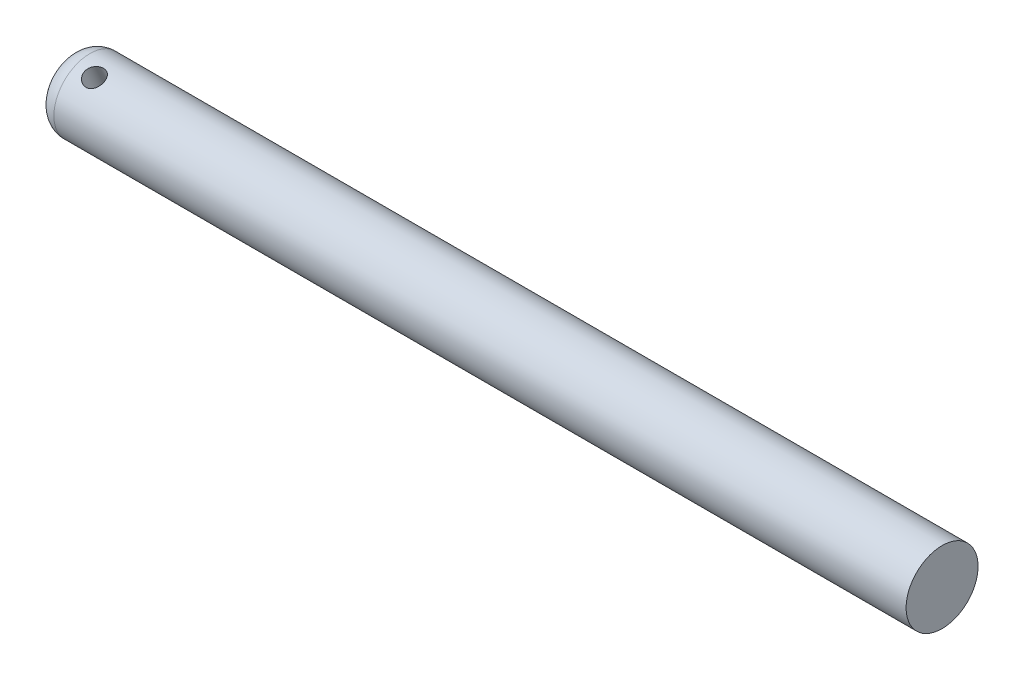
ISO-10303-21;
HEADER;
FILE_DESCRIPTION(('STEP AP214'),'2;1');
FILE_NAME('part.step','',(''),(''),'','','');
FILE_SCHEMA(('AUTOMOTIVE_DESIGN { 1 0 10303 214 1 1 1 1 }'));
ENDSEC;
DATA;
#1=APPLICATION_CONTEXT('core data for automotive mechanical design processes');
#2=APPLICATION_PROTOCOL_DEFINITION('international standard','automotive_design',2000,#1);
#3=PRODUCT_CONTEXT('',#1,'mechanical');
#4=PRODUCT('Part','Part','',(#3));
#5=PRODUCT_RELATED_PRODUCT_CATEGORY('part','',(#4));
#6=PRODUCT_DEFINITION_FORMATION('','',#4);
#7=PRODUCT_DEFINITION_CONTEXT('part definition',#1,'design');
#8=PRODUCT_DEFINITION('design','',#6,#7);
#9=PRODUCT_DEFINITION_SHAPE('','',#8);
#10=(LENGTH_UNIT() NAMED_UNIT(*) SI_UNIT(.MILLI.,.METRE.));
#11=(NAMED_UNIT(*) PLANE_ANGLE_UNIT() SI_UNIT($,.RADIAN.));
#12=(NAMED_UNIT(*) SI_UNIT($,.STERADIAN.) SOLID_ANGLE_UNIT());
#13=UNCERTAINTY_MEASURE_WITH_UNIT(LENGTH_MEASURE(1.E-05),#10,'distance_accuracy_value','');
#14=(GEOMETRIC_REPRESENTATION_CONTEXT(3) GLOBAL_UNCERTAINTY_ASSIGNED_CONTEXT((#13)) GLOBAL_UNIT_ASSIGNED_CONTEXT((#10,
#11,#12)) REPRESENTATION_CONTEXT('',''));
#15=CARTESIAN_POINT('',(0.,0.,0.));
#16=DIRECTION('',(0.,0.,1.));
#17=DIRECTION('',(1.,0.,0.));
#18=AXIS2_PLACEMENT_3D('',#15,#16,#17);
#19=CARTESIAN_POINT('',(-52.7444416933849,153.686378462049,0.));
#20=DIRECTION('',(-1.,0.,0.));
#21=DIRECTION('',(0.,0.,1.));
#22=AXIS2_PLACEMENT_3D('',#19,#20,#21);
#23=PLANE('',#22);
#24=CARTESIAN_POINT('',(-52.7444416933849,151.804700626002,0.));
#25=DIRECTION('',(-1.,0.,0.));
#26=DIRECTION('',(0.,0.,1.));
#27=AXIS2_PLACEMENT_3D('',#24,#25,#26);
#28=CIRCLE('',#27,1.88167783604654);
#29=CARTESIAN_POINT('',(-52.7444416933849,151.804700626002,1.88167783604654));
#30=VERTEX_POINT('',#29);
#31=EDGE_CURVE('E40',#30,#30,#28,.T.);
#32=ORIENTED_EDGE('',*,*,#31,.F.);
#33=EDGE_LOOP('',(#32));
#34=FACE_BOUND('',#33,.T.);
#35=ADVANCED_FACE('F30',(#34),#23,.F.);
#36=CARTESIAN_POINT('',(-98.293848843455,151.804700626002,0.));
#37=DIRECTION('',(-1.,0.,0.));
#38=DIRECTION('',(0.,0.,1.));
#39=AXIS2_PLACEMENT_3D('',#36,#37,#38);
#40=CYLINDRICAL_SURFACE('',#39,1.88167783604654);
#41=CARTESIAN_POINT('',(-97.293848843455,151.804700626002,0.));
#42=DIRECTION('',(1.,0.,0.));
#43=DIRECTION('',(0.,0.,-1.));
#44=AXIS2_PLACEMENT_3D('',#41,#42,#43);
#45=CIRCLE('',#44,1.88167783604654);
#46=CARTESIAN_POINT('',(-97.293848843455,151.804700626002,-1.88167783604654));
#47=VERTEX_POINT('',#46);
#48=EDGE_CURVE('E10',#47,#47,#45,.T.);
#49=ORIENTED_EDGE('',*,*,#48,.T.);
#50=EDGE_LOOP('',(#49));
#51=FACE_BOUND('',#50,.T.);
#52=CARTESIAN_POINT('',(-96.293848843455,149.945334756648,-0.288911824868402));
#53=CARTESIAN_POINT('',(-96.2663009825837,149.945334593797,-0.288912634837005));
#54=CARTESIAN_POINT('',(-96.2387459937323,149.945694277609,-0.2912552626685));
#55=CARTESIAN_POINT('',(-96.1844315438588,149.947170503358,-0.300523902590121));
#56=CARTESIAN_POINT('',(-96.1576724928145,149.948287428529,-0.307452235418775));
#57=CARTESIAN_POINT('',(-96.1057434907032,149.951381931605,-0.325584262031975));
#58=CARTESIAN_POINT('',(-96.0805713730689,149.953358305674,-0.336781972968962));
#59=CARTESIAN_POINT('',(-96.0324296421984,149.958324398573,-0.363020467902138));
#60=CARTESIAN_POINT('',(-96.0094601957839,149.961314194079,-0.378061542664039));
#61=CARTESIAN_POINT('',(-95.9658053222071,149.968562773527,-0.411841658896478));
#62=CARTESIAN_POINT('',(-95.9451827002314,149.972848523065,-0.430656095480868));
#63=CARTESIAN_POINT('',(-95.9073619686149,149.982840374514,-0.471137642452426));
#64=CARTESIAN_POINT('',(-95.8901642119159,149.988546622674,-0.492805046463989));
#65=CARTESIAN_POINT('',(-95.8594197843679,150.001615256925,-0.538675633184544));
#66=CARTESIAN_POINT('',(-95.8459355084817,150.009002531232,-0.562913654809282));
#67=CARTESIAN_POINT('',(-95.8234076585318,150.025426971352,-0.612851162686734));
#68=CARTESIAN_POINT('',(-95.8143633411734,150.034463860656,-0.638550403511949));
#69=CARTESIAN_POINT('',(-95.8011752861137,150.053880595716,-0.689984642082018));
#70=CARTESIAN_POINT('',(-95.7969247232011,150.064225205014,-0.715705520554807));
#71=CARTESIAN_POINT('',(-95.7931087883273,150.086189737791,-0.766947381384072));
#72=CARTESIAN_POINT('',(-95.7935426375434,150.097809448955,-0.792468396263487));
#73=CARTESIAN_POINT('',(-95.7990078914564,150.121662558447,-0.841920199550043));
#74=CARTESIAN_POINT('',(-95.80392388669,150.133873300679,-0.865874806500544));
#75=CARTESIAN_POINT('',(-95.8180274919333,150.158733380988,-0.912247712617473));
#76=CARTESIAN_POINT('',(-95.8272153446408,150.171382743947,-0.934665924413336));
#77=CARTESIAN_POINT('',(-95.8496905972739,150.196745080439,-0.977660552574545));
#78=CARTESIAN_POINT('',(-95.8630176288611,150.209457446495,-0.998216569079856));
#79=CARTESIAN_POINT('',(-95.8933625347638,150.234273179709,-1.03682038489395));
#80=CARTESIAN_POINT('',(-95.9103811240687,150.246376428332,-1.05486769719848));
#81=CARTESIAN_POINT('',(-95.948239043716,150.269767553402,-1.08863546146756));
#82=CARTESIAN_POINT('',(-95.9691790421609,150.281019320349,-1.10426819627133));
#83=CARTESIAN_POINT('',(-96.0139667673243,150.301687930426,-1.1322400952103));
#84=CARTESIAN_POINT('',(-96.0378146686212,150.3111046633,-1.14457906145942));
#85=CARTESIAN_POINT('',(-96.0879456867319,150.327604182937,-1.1657959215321));
#86=CARTESIAN_POINT('',(-96.1142427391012,150.334672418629,-1.17465229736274));
#87=CARTESIAN_POINT('',(-96.1684023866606,150.345931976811,-1.18860708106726));
#88=CARTESIAN_POINT('',(-96.1962645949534,150.350124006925,-1.19370641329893));
#89=CARTESIAN_POINT('',(-96.2518774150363,150.35525990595,-1.19993708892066));
#90=CARTESIAN_POINT('',(-96.2796067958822,150.356296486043,-1.20118170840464));
#91=CARTESIAN_POINT('',(-96.3349302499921,150.355313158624,-1.19999502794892));
#92=CARTESIAN_POINT('',(-96.3625243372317,150.353293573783,-1.19756411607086));
#93=CARTESIAN_POINT('',(-96.416250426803,150.34640468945,-1.18916470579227));
#94=CARTESIAN_POINT('',(-96.4424002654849,150.341590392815,-1.18326445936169));
#95=CARTESIAN_POINT('',(-96.4930949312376,150.329458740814,-1.1681038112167));
#96=CARTESIAN_POINT('',(-96.5176395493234,150.322141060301,-1.15884297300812));
#97=CARTESIAN_POINT('',(-96.565018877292,150.305241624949,-1.13689465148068));
#98=CARTESIAN_POINT('',(-96.5878045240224,150.295613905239,-1.12413673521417));
#99=CARTESIAN_POINT('',(-96.6304888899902,150.274710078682,-1.0955153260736));
#100=CARTESIAN_POINT('',(-96.650387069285,150.263433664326,-1.07965125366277));
#101=CARTESIAN_POINT('',(-96.687317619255,150.239454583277,-1.04459524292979));
#102=CARTESIAN_POINT('',(-96.7042514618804,150.226720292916,-1.02532092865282));
#103=CARTESIAN_POINT('',(-96.7340508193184,150.20072487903,-0.984156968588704));
#104=CARTESIAN_POINT('',(-96.7469165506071,150.18746378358,-0.96226746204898));
#105=CARTESIAN_POINT('',(-96.7680966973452,150.161121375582,-0.916541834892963));
#106=CARTESIAN_POINT('',(-96.7764450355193,150.148039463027,-0.892721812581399));
#107=CARTESIAN_POINT('',(-96.7884520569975,150.122500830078,-0.843611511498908));
#108=CARTESIAN_POINT('',(-96.7921117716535,150.110043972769,-0.81832155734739));
#109=CARTESIAN_POINT('',(-96.7945734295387,150.086573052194,-0.767790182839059));
#110=CARTESIAN_POINT('',(-96.793519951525,150.075526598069,-0.742570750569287));
#111=CARTESIAN_POINT('',(-96.7869205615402,150.054746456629,-0.692181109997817));
#112=CARTESIAN_POINT('',(-96.7813748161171,150.045012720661,-0.667010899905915));
#113=CARTESIAN_POINT('',(-96.7660298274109,150.027086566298,-0.617644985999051));
#114=CARTESIAN_POINT('',(-96.7562597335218,150.018884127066,-0.593443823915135));
#115=CARTESIAN_POINT('',(-96.7327694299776,150.00397680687,-0.546544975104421));
#116=CARTESIAN_POINT('',(-96.719048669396,149.997272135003,-0.523847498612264));
#117=CARTESIAN_POINT('',(-96.6876223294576,149.985140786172,-0.480045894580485));
#118=CARTESIAN_POINT('',(-96.6698207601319,149.979752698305,-0.458999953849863));
#119=CARTESIAN_POINT('',(-96.6309204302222,149.970348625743,-0.419845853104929));
#120=CARTESIAN_POINT('',(-96.6098208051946,149.966333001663,-0.401738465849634));
#121=CARTESIAN_POINT('',(-96.5643700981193,149.959421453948,-0.368710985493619));
#122=CARTESIAN_POINT('',(-96.539958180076,149.956551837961,-0.353868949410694));
#123=CARTESIAN_POINT('',(-96.4889180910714,149.951867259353,-0.328463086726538));
#124=CARTESIAN_POINT('',(-96.4622913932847,149.950051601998,-0.3178964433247));
#125=CARTESIAN_POINT('',(-96.4121079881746,149.947539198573,-0.302837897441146));
#126=CARTESIAN_POINT('',(-96.3887701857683,149.94670721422,-0.29763109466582));
#127=CARTESIAN_POINT('',(-96.341572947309,149.945605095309,-0.290667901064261));
#128=CARTESIAN_POINT('',(-96.3177135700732,149.945334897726,-0.288911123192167));
#129=CARTESIAN_POINT('',(-96.293848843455,149.945334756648,-0.288911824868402));
#130=B_SPLINE_CURVE_WITH_KNOTS('',3,(#52,#53,#54,#55,#56,#57,#58,#59,#60,#61,#62,#63,#64,#65,
#66,#67,#68,#69,#70,#71,#72,#73,#74,#75,#76,#77,#78,#79,#80,#81,#82,#83,#84,#85,#86,#87,#88,#89,
#90,#91,#92,#93,#94,#95,#96,#97,#98,#99,#100,#101,#102,#103,#104,#105,#106,#107,#108,#109,#110,
#111,#112,#113,#114,#115,#116,#117,#118,#119,#120,#121,#122,#123,#124,#125,#126,#127,#128,#129),
.UNSPECIFIED.,.T.,.F.,(4,2,2,2,2,2,2,2,2,2,2,2,2,2,2,2,2,2,2,2,2,2,2,2,2,2,2,2,2,2,2,2,2,2,2,2,
2,2,4),(0.,0.0825558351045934,0.165153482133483,0.247635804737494,0.330124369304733,
0.4144636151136,0.498811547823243,0.58450051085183,0.670175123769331,0.753900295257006,
0.837611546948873,0.919226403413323,1.00084589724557,1.08327231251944,1.1657147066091,
1.25067061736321,1.33563163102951,1.4211096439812,1.50656661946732,1.58948727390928,
1.67239917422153,1.75373208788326,1.83507556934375,1.91819592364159,2.00133180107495,
2.08685138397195,2.17236641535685,2.25723004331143,2.34207500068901,2.42433546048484,
2.50659287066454,2.58829151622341,2.670001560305,2.75387761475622,2.83777569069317,
2.92350208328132,3.0091719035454,3.08069809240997,3.15221625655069),.UNSPECIFIED.);
#131=CARTESIAN_POINT('',(-96.293848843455,149.945334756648,-0.288911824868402));
#132=VERTEX_POINT('',#131);
#133=EDGE_CURVE('E44',#132,#132,#130,.T.);
#134=ORIENTED_EDGE('',*,*,#133,.T.);
#135=EDGE_LOOP('',(#134));
#136=FACE_BOUND('',#135,.T.);
#137=CARTESIAN_POINT('',(-96.293848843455,153.253477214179,1.20073222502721));
#138=CARTESIAN_POINT('',(-96.3213967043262,153.2534779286,1.20073181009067));
#139=CARTESIAN_POINT('',(-96.3489516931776,153.254993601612,1.19890971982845));
#140=CARTESIAN_POINT('',(-96.4032661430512,153.260955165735,1.19166081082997));
#141=CARTESIAN_POINT('',(-96.4300251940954,153.26540254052,1.18623216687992));
#142=CARTESIAN_POINT('',(-96.4819541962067,153.276928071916,1.17189660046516));
#143=CARTESIAN_POINT('',(-96.507126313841,153.284002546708,1.16299454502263));
#144=CARTESIAN_POINT('',(-96.5552680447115,153.30035738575,1.14188435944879));
#145=CARTESIAN_POINT('',(-96.578237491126,153.309637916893,1.12967597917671));
#146=CARTESIAN_POINT('',(-96.6218923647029,153.330126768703,1.1018579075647));
#147=CARTESIAN_POINT('',(-96.6425149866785,153.341373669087,1.08617805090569));
#148=CARTESIAN_POINT('',(-96.680335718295,153.365062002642,1.05186397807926));
#149=CARTESIAN_POINT('',(-96.697533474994,153.377503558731,1.03322945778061));
#150=CARTESIAN_POINT('',(-96.728277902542,153.403187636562,0.993039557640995));
#151=CARTESIAN_POINT('',(-96.7417621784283,153.416439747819,0.971442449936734));
#152=CARTESIAN_POINT('',(-96.7642900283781,153.442944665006,0.926044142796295));
#153=CARTESIAN_POINT('',(-96.7733343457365,153.456197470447,0.90224331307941));
#154=CARTESIAN_POINT('',(-96.7865224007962,153.481839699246,0.853612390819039));
#155=CARTESIAN_POINT('',(-96.7907729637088,153.494241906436,0.828818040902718));
#156=CARTESIAN_POINT('',(-96.7945888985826,153.518051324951,0.77840692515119));
#157=CARTESIAN_POINT('',(-96.7941550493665,153.529458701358,0.752790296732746));
#158=CARTESIAN_POINT('',(-96.7886897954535,153.550675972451,0.702151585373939));
#159=CARTESIAN_POINT('',(-96.7837738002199,153.560518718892,0.677130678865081));
#160=CARTESIAN_POINT('',(-96.7696701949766,153.578763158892,0.627778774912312));
#161=CARTESIAN_POINT('',(-96.7604823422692,153.58716477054,0.603447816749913));
#162=CARTESIAN_POINT('',(-96.738007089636,153.602546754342,0.555959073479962));
#163=CARTESIAN_POINT('',(-96.7246800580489,153.609512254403,0.532815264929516));
#164=CARTESIAN_POINT('',(-96.6943351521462,153.621968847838,0.488646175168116));
#165=CARTESIAN_POINT('',(-96.6773165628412,153.62745965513,0.467621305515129));
#166=CARTESIAN_POINT('',(-96.6394586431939,153.637239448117,0.427724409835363));
#167=CARTESIAN_POINT('',(-96.6185186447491,153.64148668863,0.408937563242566));
#168=CARTESIAN_POINT('',(-96.5737309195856,153.64873129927,0.374920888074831));
#169=CARTESIAN_POINT('',(-96.5498830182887,153.651728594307,0.359691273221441));
#170=CARTESIAN_POINT('',(-96.499752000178,153.656678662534,0.33327373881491));
#171=CARTESIAN_POINT('',(-96.4734549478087,153.65862496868,0.322110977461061));
#172=CARTESIAN_POINT('',(-96.4192953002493,153.661610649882,0.304430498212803));
#173=CARTESIAN_POINT('',(-96.3914330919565,153.66265024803,0.297911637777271));
#174=CARTESIAN_POINT('',(-96.3358202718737,153.663911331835,0.28993614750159));
#175=CARTESIAN_POINT('',(-96.3080908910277,153.664156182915,0.288335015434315));
#176=CARTESIAN_POINT('',(-96.2527674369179,153.663919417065,0.289857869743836));
#177=CARTESIAN_POINT('',(-96.2251733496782,153.663437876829,0.292981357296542));
#178=CARTESIAN_POINT('',(-96.171447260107,153.661714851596,0.303706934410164));
#179=CARTESIAN_POINT('',(-96.145297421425,153.660488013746,0.31122259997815));
#180=CARTESIAN_POINT('',(-96.0946027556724,153.657177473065,0.330355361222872));
#181=CARTESIAN_POINT('',(-96.0700581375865,153.65509365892,0.341972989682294));
#182=CARTESIAN_POINT('',(-96.0226788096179,153.649860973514,0.369174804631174));
#183=CARTESIAN_POINT('',(-95.9998931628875,153.646689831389,0.384840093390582));
#184=CARTESIAN_POINT('',(-95.9572087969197,153.639114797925,0.419463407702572));
#185=CARTESIAN_POINT('',(-95.937310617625,153.634710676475,0.438422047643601));
#186=CARTESIAN_POINT('',(-95.9003800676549,153.624356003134,0.479613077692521));
#187=CARTESIAN_POINT('',(-95.8834462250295,153.618364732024,0.501923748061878));
#188=CARTESIAN_POINT('',(-95.8536468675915,153.604773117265,0.548673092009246));
#189=CARTESIAN_POINT('',(-95.8407811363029,153.597172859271,0.573111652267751));
#190=CARTESIAN_POINT('',(-95.8196009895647,153.580395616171,0.623144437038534));
#191=CARTESIAN_POINT('',(-95.8112526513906,153.571231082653,0.648728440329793));
#192=CARTESIAN_POINT('',(-95.7992456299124,153.55138673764,0.700402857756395));
#193=CARTESIAN_POINT('',(-95.7955859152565,153.54070725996,0.726493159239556));
#194=CARTESIAN_POINT('',(-95.7931242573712,153.518428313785,0.777561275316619));
#195=CARTESIAN_POINT('',(-95.7941777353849,153.506866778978,0.802548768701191));
#196=CARTESIAN_POINT('',(-95.8007771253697,153.482910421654,0.851508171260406));
#197=CARTESIAN_POINT('',(-95.8063228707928,153.470515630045,0.875480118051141));
#198=CARTESIAN_POINT('',(-95.821667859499,153.445434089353,0.92162398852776));
#199=CARTESIAN_POINT('',(-95.8314379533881,153.432749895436,0.943807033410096));
#200=CARTESIAN_POINT('',(-95.8549282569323,153.407514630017,0.986055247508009));
#201=CARTESIAN_POINT('',(-95.8686490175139,153.394963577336,1.00612012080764));
#202=CARTESIAN_POINT('',(-95.9000753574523,153.370207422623,1.04423682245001));
#203=CARTESIAN_POINT('',(-95.917876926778,153.358020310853,1.06222118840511));
#204=CARTESIAN_POINT('',(-95.9567772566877,153.334936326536,1.09521527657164));
#205=CARTESIAN_POINT('',(-95.9778768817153,153.324039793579,1.11022421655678));
#206=CARTESIAN_POINT('',(-96.0233275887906,153.303891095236,1.13729105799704));
#207=CARTESIAN_POINT('',(-96.0477395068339,153.294679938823,1.14927752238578));
#208=CARTESIAN_POINT('',(-96.0987795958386,153.278761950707,1.16962502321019));
#209=CARTESIAN_POINT('',(-96.1254062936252,153.272053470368,1.17798844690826));
#210=CARTESIAN_POINT('',(-96.1755896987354,153.26244342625,1.1898509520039));
#211=CARTESIAN_POINT('',(-96.1989275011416,153.259096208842,1.19392515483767));
#212=CARTESIAN_POINT('',(-96.246124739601,153.254612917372,1.1993658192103));
#213=CARTESIAN_POINT('',(-96.2699841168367,153.253476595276,1.20073258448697));
#214=CARTESIAN_POINT('',(-96.293848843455,153.253477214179,1.20073222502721));
#215=B_SPLINE_CURVE_WITH_KNOTS('',3,(#137,#138,#139,#140,#141,#142,#143,#144,#145,#146,#147,
#148,#149,#150,#151,#152,#153,#154,#155,#156,#157,#158,#159,#160,#161,#162,#163,#164,#165,#166,
#167,#168,#169,#170,#171,#172,#173,#174,#175,#176,#177,#178,#179,#180,#181,#182,#183,#184,#185,
#186,#187,#188,#189,#190,#191,#192,#193,#194,#195,#196,#197,#198,#199,#200,#201,#202,#203,#204,
#205,#206,#207,#208,#209,#210,#211,#212,#213,#214),.UNSPECIFIED.,.T.,.F.,(4,2,2,2,2,2,2,2,2,2,2,
2,2,2,2,2,2,2,2,2,2,2,2,2,2,2,2,2,2,2,2,2,2,2,2,2,2,2,4),(0.,0.0825558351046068,
0.165153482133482,0.247635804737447,0.330124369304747,0.414463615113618,0.498811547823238,
0.584500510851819,0.670175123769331,0.753900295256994,0.837611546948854,0.9192264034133,
1.00084589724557,1.08327231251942,1.16571470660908,1.25067061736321,1.3356316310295,
1.4211096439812,1.5065666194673,1.58948727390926,1.67239917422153,1.75373208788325,
1.83507556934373,1.91819592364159,2.00133180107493,2.08685138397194,2.17236641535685,
2.25723004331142,2.34207500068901,2.42433546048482,2.50659287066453,2.58829151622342,
2.67000156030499,2.75387761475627,2.83777569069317,2.92350208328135,3.00917190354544,
3.08069809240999,3.15221625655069),.UNSPECIFIED.);
#216=CARTESIAN_POINT('',(-96.293848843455,153.253477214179,1.20073222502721));
#217=VERTEX_POINT('',#216);
#218=EDGE_CURVE('E52',#217,#217,#215,.T.);
#219=ORIENTED_EDGE('',*,*,#218,.T.);
#220=EDGE_LOOP('',(#219));
#221=FACE_BOUND('',#220,.T.);
#222=ORIENTED_EDGE('',*,*,#31,.T.);
#223=EDGE_LOOP('',(#222));
#224=FACE_BOUND('',#223,.T.);
#225=ADVANCED_FACE('F55',(#51,#136,#221,#224),#40,.T.);
#226=CARTESIAN_POINT('',(-98.293848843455,153.686378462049,0.));
#227=DIRECTION('',(1.,0.,0.));
#228=DIRECTION('',(0.,0.,-1.));
#229=AXIS2_PLACEMENT_3D('',#226,#227,#228);
#230=PLANE('',#229);
#231=CARTESIAN_POINT('',(-98.293848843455,151.804700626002,0.));
#232=DIRECTION('',(1.,0.,0.));
#233=DIRECTION('',(0.,0.,-1.));
#234=AXIS2_PLACEMENT_3D('',#231,#232,#233);
#235=CIRCLE('',#234,0.881677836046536);
#236=CARTESIAN_POINT('',(-98.293848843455,151.804700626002,-0.881677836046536));
#237=VERTEX_POINT('',#236);
#238=EDGE_CURVE('E36',#237,#237,#235,.F.);
#239=ORIENTED_EDGE('',*,*,#238,.T.);
#240=EDGE_LOOP('',(#239));
#241=FACE_BOUND('',#240,.T.);
#242=ADVANCED_FACE('F63',(#241),#230,.F.);
#243=CARTESIAN_POINT('',(-96.293848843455,149.535773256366,-1.02168942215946));
#244=DIRECTION('',(0.,0.911820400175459,0.410589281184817));
#245=DIRECTION('',(0.,-0.410589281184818,0.91182040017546));
#246=AXIS2_PLACEMENT_3D('',#243,#244,#245);
#247=CYLINDRICAL_SURFACE('',#246,0.5);
#248=ORIENTED_EDGE('',*,*,#218,.F.);
#249=EDGE_LOOP('',(#248));
#250=FACE_BOUND('',#249,.T.);
#251=ORIENTED_EDGE('',*,*,#133,.F.);
#252=EDGE_LOOP('',(#251));
#253=FACE_BOUND('',#252,.T.);
#254=ADVANCED_FACE('F58',(#250,#253),#247,.F.);
#255=CARTESIAN_POINT('',(-97.293848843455,151.804700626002,0.));
#256=DIRECTION('',(1.,0.,0.));
#257=DIRECTION('',(0.,0.,-1.));
#258=AXIS2_PLACEMENT_3D('',#255,#256,#257);
#259=DEGENERATE_TOROIDAL_SURFACE('',#258,0.881677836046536,1.,.T.);
#260=ORIENTED_EDGE('',*,*,#48,.F.);
#261=EDGE_LOOP('',(#260));
#262=FACE_BOUND('',#261,.T.);
#263=ORIENTED_EDGE('',*,*,#238,.F.);
#264=EDGE_LOOP('',(#263));
#265=FACE_BOUND('',#264,.T.);
#266=ADVANCED_FACE('F62',(#262,#265),#259,.T.);
#267=CLOSED_SHELL('',(#35,#225,#242,#254,#266));
#268=MANIFOLD_SOLID_BREP('B2',#267);
#269=ADVANCED_BREP_SHAPE_REPRESENTATION('',(#18,#268),#14);
#270=SHAPE_DEFINITION_REPRESENTATION(#9,#269);
ENDSEC;
END-ISO-10303-21;
